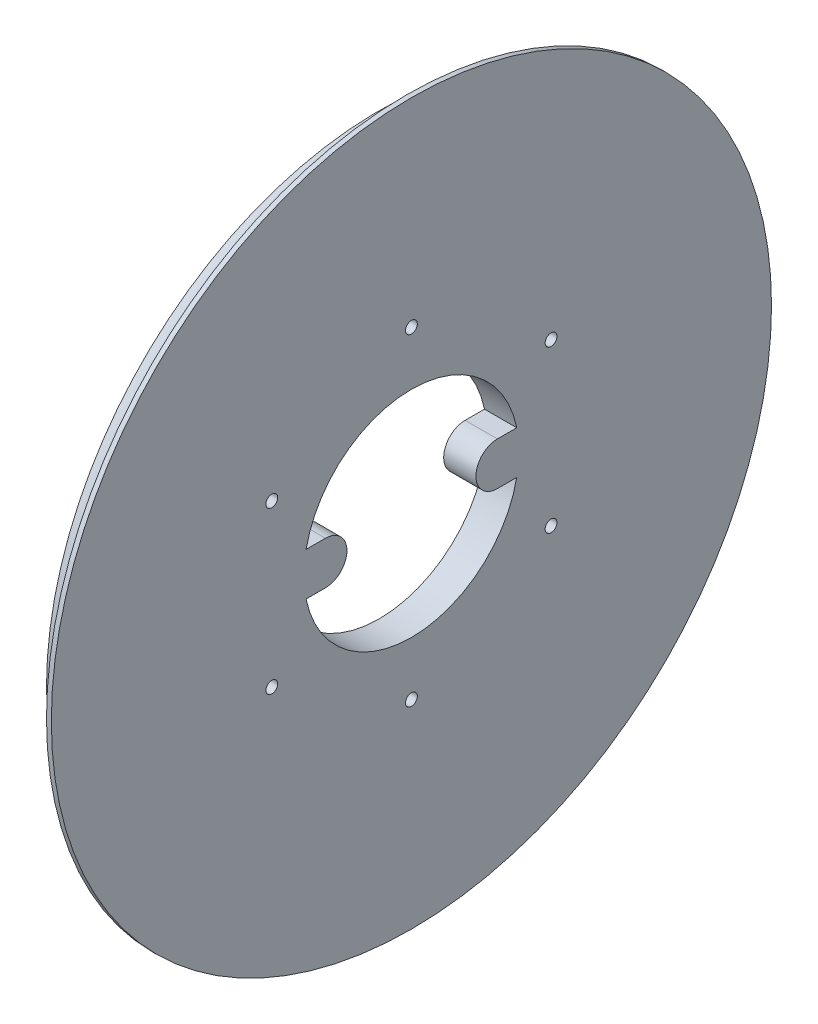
ISO-10303-21;
HEADER;
FILE_DESCRIPTION(('STEP AP214'),'2;1');
FILE_NAME('part.step','',(''),(''),'','','');
FILE_SCHEMA(('AUTOMOTIVE_DESIGN { 1 0 10303 214 1 1 1 1 }'));
ENDSEC;
DATA;
#1=APPLICATION_CONTEXT('core data for automotive mechanical design processes');
#2=APPLICATION_PROTOCOL_DEFINITION('international standard','automotive_design',2000,#1);
#3=PRODUCT_CONTEXT('',#1,'mechanical');
#4=PRODUCT('Part','Part','',(#3));
#5=PRODUCT_RELATED_PRODUCT_CATEGORY('part','',(#4));
#6=PRODUCT_DEFINITION_FORMATION('','',#4);
#7=PRODUCT_DEFINITION_CONTEXT('part definition',#1,'design');
#8=PRODUCT_DEFINITION('design','',#6,#7);
#9=PRODUCT_DEFINITION_SHAPE('','',#8);
#10=(LENGTH_UNIT() NAMED_UNIT(*) SI_UNIT(.MILLI.,.METRE.));
#11=(NAMED_UNIT(*) PLANE_ANGLE_UNIT() SI_UNIT($,.RADIAN.));
#12=(NAMED_UNIT(*) SI_UNIT($,.STERADIAN.) SOLID_ANGLE_UNIT());
#13=UNCERTAINTY_MEASURE_WITH_UNIT(LENGTH_MEASURE(1.E-05),#10,'distance_accuracy_value','');
#14=(GEOMETRIC_REPRESENTATION_CONTEXT(3) GLOBAL_UNCERTAINTY_ASSIGNED_CONTEXT((#13)) GLOBAL_UNIT_ASSIGNED_CONTEXT((#10,
#11,#12)) REPRESENTATION_CONTEXT('',''));
#15=CARTESIAN_POINT('',(0.,0.,0.));
#16=DIRECTION('',(0.,0.,1.));
#17=DIRECTION('',(1.,0.,0.));
#18=AXIS2_PLACEMENT_3D('',#15,#16,#17);
#19=CARTESIAN_POINT('',(11.9999999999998,66.9999999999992,0.));
#20=DIRECTION('',(1.,0.,0.));
#21=DIRECTION('',(0.,0.,-1.));
#22=AXIS2_PLACEMENT_3D('',#19,#20,#21);
#23=PLANE('',#22);
#24=CARTESIAN_POINT('',(11.9999999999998,15.0000000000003,-25.980762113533));
#25=DIRECTION('',(-1.,0.,0.));
#26=DIRECTION('',(0.,0.,1.));
#27=AXIS2_PLACEMENT_3D('',#24,#25,#26);
#28=CIRCLE('',#27,1.1);
#29=CARTESIAN_POINT('',(11.9999999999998,15.0000000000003,-24.880762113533));
#30=VERTEX_POINT('',#29);
#31=EDGE_CURVE('E249',#30,#30,#28,.T.);
#32=ORIENTED_EDGE('',*,*,#31,.T.);
#33=EDGE_LOOP('',(#32));
#34=FACE_BOUND('',#33,.T.);
#35=CARTESIAN_POINT('',(11.9999999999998,-15.0000000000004,-25.9807621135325));
#36=DIRECTION('',(-1.,0.,0.));
#37=DIRECTION('',(0.,0.,1.));
#38=AXIS2_PLACEMENT_3D('',#35,#36,#37);
#39=CIRCLE('',#38,1.100000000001);
#40=CARTESIAN_POINT('',(11.9999999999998,-15.0000000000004,-24.8807621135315));
#41=VERTEX_POINT('',#40);
#42=EDGE_CURVE('E257',#41,#41,#39,.T.);
#43=ORIENTED_EDGE('',*,*,#42,.T.);
#44=EDGE_LOOP('',(#43));
#45=FACE_BOUND('',#44,.T.);
#46=CARTESIAN_POINT('',(11.9999999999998,-30.,8.52170513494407E-13));
#47=DIRECTION('',(-1.,0.,0.));
#48=DIRECTION('',(0.,0.,1.));
#49=AXIS2_PLACEMENT_3D('',#46,#47,#48);
#50=CIRCLE('',#49,1.10000000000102);
#51=CARTESIAN_POINT('',(11.9999999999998,-30.,1.10000000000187));
#52=VERTEX_POINT('',#51);
#53=EDGE_CURVE('E263',#52,#52,#50,.T.);
#54=ORIENTED_EDGE('',*,*,#53,.T.);
#55=EDGE_LOOP('',(#54));
#56=FACE_BOUND('',#55,.T.);
#57=CARTESIAN_POINT('',(11.9999999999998,-14.9999999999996,25.9807621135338));
#58=DIRECTION('',(-1.,0.,0.));
#59=DIRECTION('',(0.,0.,1.));
#60=AXIS2_PLACEMENT_3D('',#57,#58,#59);
#61=CIRCLE('',#60,1.10000000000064);
#62=CARTESIAN_POINT('',(11.9999999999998,-14.9999999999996,27.0807621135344));
#63=VERTEX_POINT('',#62);
#64=EDGE_CURVE('E269',#63,#63,#61,.T.);
#65=ORIENTED_EDGE('',*,*,#64,.T.);
#66=EDGE_LOOP('',(#65));
#67=FACE_BOUND('',#66,.T.);
#68=CARTESIAN_POINT('',(11.9999999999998,14.9999999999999,25.9807621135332));
#69=DIRECTION('',(-1.,0.,0.));
#70=DIRECTION('',(0.,0.,1.));
#71=AXIS2_PLACEMENT_3D('',#68,#69,#70);
#72=CIRCLE('',#71,1.1);
#73=CARTESIAN_POINT('',(11.9999999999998,14.9999999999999,27.0807621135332));
#74=VERTEX_POINT('',#73);
#75=EDGE_CURVE('E275',#74,#74,#72,.T.);
#76=ORIENTED_EDGE('',*,*,#75,.T.);
#77=EDGE_LOOP('',(#76));
#78=FACE_BOUND('',#77,.T.);
#79=CARTESIAN_POINT('',(11.9999999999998,30.,0.));
#80=DIRECTION('',(-1.,0.,0.));
#81=DIRECTION('',(0.,0.,1.));
#82=AXIS2_PLACEMENT_3D('',#79,#80,#81);
#83=CIRCLE('',#82,1.1);
#84=CARTESIAN_POINT('',(11.9999999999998,30.,1.1));
#85=VERTEX_POINT('',#84);
#86=EDGE_CURVE('E143',#85,#85,#83,.T.);
#87=ORIENTED_EDGE('',*,*,#86,.T.);
#88=EDGE_LOOP('',(#87));
#89=FACE_BOUND('',#88,.T.);
#90=CARTESIAN_POINT('',(11.9999999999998,0.,-16.));
#91=DIRECTION('',(1.,0.,0.));
#92=DIRECTION('',(0.,0.,1.));
#93=AXIS2_PLACEMENT_3D('',#90,#91,#92);
#94=CIRCLE('',#93,4.);
#95=CARTESIAN_POINT('',(11.9999999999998,4.,-16.));
#96=VERTEX_POINT('',#95);
#97=CARTESIAN_POINT('',(11.9999999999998,-4.,-16.));
#98=VERTEX_POINT('',#97);
#99=EDGE_CURVE('E103',#96,#98,#94,.T.);
#100=ORIENTED_EDGE('',*,*,#99,.T.);
#101=DIRECTION('',(0.,0.,-1.));
#102=VECTOR('',#101,1.);
#103=CARTESIAN_POINT('',(11.9999999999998,-4.,-19.5959179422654));
#104=LINE('',#103,#102);
#105=CARTESIAN_POINT('',(11.9999999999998,-4.,-19.5959179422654));
#106=VERTEX_POINT('',#105);
#107=EDGE_CURVE('E112',#98,#106,#104,.T.);
#108=ORIENTED_EDGE('',*,*,#107,.T.);
#109=CARTESIAN_POINT('',(11.9999999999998,0.,0.));
#110=DIRECTION('',(-1.,0.,0.));
#111=DIRECTION('',(0.,0.,1.));
#112=AXIS2_PLACEMENT_3D('',#109,#110,#111);
#113=CIRCLE('',#112,20.);
#114=CARTESIAN_POINT('',(11.9999999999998,-4.,19.5959179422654));
#115=VERTEX_POINT('',#114);
#116=EDGE_CURVE('E51',#106,#115,#113,.T.);
#117=ORIENTED_EDGE('',*,*,#116,.T.);
#118=DIRECTION('',(0.,0.,-1.));
#119=VECTOR('',#118,1.);
#120=CARTESIAN_POINT('',(11.9999999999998,-4.,19.5959179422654));
#121=LINE('',#120,#119);
#122=CARTESIAN_POINT('',(11.9999999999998,-4.,16.));
#123=VERTEX_POINT('',#122);
#124=EDGE_CURVE('E129',#115,#123,#121,.T.);
#125=ORIENTED_EDGE('',*,*,#124,.T.);
#126=CARTESIAN_POINT('',(11.9999999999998,0.,16.));
#127=DIRECTION('',(1.,0.,0.));
#128=DIRECTION('',(0.,0.,-1.));
#129=AXIS2_PLACEMENT_3D('',#126,#127,#128);
#130=CIRCLE('',#129,4.);
#131=CARTESIAN_POINT('',(11.9999999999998,4.,16.));
#132=VERTEX_POINT('',#131);
#133=EDGE_CURVE('E132',#123,#132,#130,.T.);
#134=ORIENTED_EDGE('',*,*,#133,.T.);
#135=DIRECTION('',(0.,0.,1.));
#136=VECTOR('',#135,1.);
#137=CARTESIAN_POINT('',(11.9999999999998,4.,19.5959179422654));
#138=LINE('',#137,#136);
#139=CARTESIAN_POINT('',(11.9999999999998,4.,19.5959179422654));
#140=VERTEX_POINT('',#139);
#141=EDGE_CURVE('E135',#132,#140,#138,.T.);
#142=ORIENTED_EDGE('',*,*,#141,.T.);
#143=CARTESIAN_POINT('',(11.9999999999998,0.,0.));
#144=DIRECTION('',(-1.,0.,0.));
#145=DIRECTION('',(0.,0.,1.));
#146=AXIS2_PLACEMENT_3D('',#143,#144,#145);
#147=CIRCLE('',#146,20.);
#148=CARTESIAN_POINT('',(11.9999999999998,4.,-19.5959179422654));
#149=VERTEX_POINT('',#148);
#150=EDGE_CURVE('E138',#140,#149,#147,.T.);
#151=ORIENTED_EDGE('',*,*,#150,.T.);
#152=DIRECTION('',(0.,0.,1.));
#153=VECTOR('',#152,1.);
#154=CARTESIAN_POINT('',(11.9999999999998,4.,-19.5959179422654));
#155=LINE('',#154,#153);
#156=EDGE_CURVE('E109',#149,#96,#155,.T.);
#157=ORIENTED_EDGE('',*,*,#156,.T.);
#158=EDGE_LOOP('',(#100,#108,#117,#125,#134,#142,#151,#157));
#159=FACE_BOUND('',#158,.T.);
#160=CARTESIAN_POINT('',(11.9999999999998,-7.77547884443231E-13,0.));
#161=DIRECTION('',(-1.,0.,0.));
#162=DIRECTION('',(0.,0.,1.));
#163=AXIS2_PLACEMENT_3D('',#160,#161,#162);
#164=CIRCLE('',#163,67.);
#165=CARTESIAN_POINT('',(11.9999999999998,-7.77547884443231E-13,67.));
#166=VERTEX_POINT('',#165);
#167=EDGE_CURVE('E11',#166,#166,#164,.T.);
#168=ORIENTED_EDGE('',*,*,#167,.F.);
#169=EDGE_LOOP('',(#168));
#170=FACE_BOUND('',#169,.T.);
#171=ADVANCED_FACE('F37',(#34,#45,#56,#67,#78,#89,#159,#170),#23,.T.);
#172=CARTESIAN_POINT('',(-19.0782144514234,-7.77547884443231E-13,0.));
#173=DIRECTION('',(-1.,0.,0.));
#174=DIRECTION('',(0.,0.,1.));
#175=AXIS2_PLACEMENT_3D('',#172,#173,#174);
#176=CYLINDRICAL_SURFACE('',#175,67.);
#177=ORIENTED_EDGE('',*,*,#167,.T.);
#178=EDGE_LOOP('',(#177));
#179=FACE_BOUND('',#178,.T.);
#180=CARTESIAN_POINT('',(11.0999999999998,-7.77547884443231E-13,0.));
#181=DIRECTION('',(-1.,0.,0.));
#182=DIRECTION('',(0.,0.,1.));
#183=AXIS2_PLACEMENT_3D('',#180,#181,#182);
#184=CIRCLE('',#183,67.);
#185=CARTESIAN_POINT('',(11.0999999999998,-7.77547884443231E-13,67.));
#186=VERTEX_POINT('',#185);
#187=EDGE_CURVE('E44',#186,#186,#184,.T.);
#188=ORIENTED_EDGE('',*,*,#187,.F.);
#189=EDGE_LOOP('',(#188));
#190=FACE_BOUND('',#189,.T.);
#191=ADVANCED_FACE('F180',(#179,#190),#176,.T.);
#192=CARTESIAN_POINT('',(5.99999999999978,-7.7715611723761E-13,0.));
#193=DIRECTION('',(-1.,0.,0.));
#194=DIRECTION('',(0.,0.,1.));
#195=AXIS2_PLACEMENT_3D('',#192,#193,#194);
#196=TOROIDAL_SURFACE('',#195,67.,5.1);
#197=ORIENTED_EDGE('',*,*,#187,.T.);
#198=EDGE_LOOP('',(#197));
#199=FACE_BOUND('',#198,.T.);
#200=CARTESIAN_POINT('',(5.99999999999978,-7.77547884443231E-13,0.));
#201=DIRECTION('',(-1.,0.,0.));
#202=DIRECTION('',(0.,0.,1.));
#203=AXIS2_PLACEMENT_3D('',#200,#201,#202);
#204=CIRCLE('',#203,61.9);
#205=CARTESIAN_POINT('',(5.99999999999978,-7.77547884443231E-13,61.9));
#206=VERTEX_POINT('',#205);
#207=EDGE_CURVE('E161',#206,#206,#204,.T.);
#208=ORIENTED_EDGE('',*,*,#207,.F.);
#209=EDGE_LOOP('',(#208));
#210=FACE_BOUND('',#209,.T.);
#211=ADVANCED_FACE('F177',(#199,#210),#196,.F.);
#212=CARTESIAN_POINT('',(5.99999999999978,61.8999999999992,0.));
#213=DIRECTION('',(1.,0.,0.));
#214=DIRECTION('',(0.,0.,-1.));
#215=AXIS2_PLACEMENT_3D('',#212,#213,#214);
#216=PLANE('',#215);
#217=CARTESIAN_POINT('',(5.99999999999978,15.0000000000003,-25.980762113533));
#218=DIRECTION('',(-1.,0.,0.));
#219=DIRECTION('',(0.,0.,1.));
#220=AXIS2_PLACEMENT_3D('',#217,#218,#219);
#221=CIRCLE('',#220,1.1);
#222=CARTESIAN_POINT('',(5.99999999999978,15.0000000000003,-24.880762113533));
#223=VERTEX_POINT('',#222);
#224=EDGE_CURVE('E252',#223,#223,#221,.T.);
#225=ORIENTED_EDGE('',*,*,#224,.F.);
#226=EDGE_LOOP('',(#225));
#227=FACE_BOUND('',#226,.T.);
#228=CARTESIAN_POINT('',(5.99999999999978,-15.0000000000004,-25.9807621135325));
#229=DIRECTION('',(-1.,0.,0.));
#230=DIRECTION('',(0.,0.,1.));
#231=AXIS2_PLACEMENT_3D('',#228,#229,#230);
#232=CIRCLE('',#231,1.100000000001);
#233=CARTESIAN_POINT('',(5.99999999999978,-15.0000000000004,-24.8807621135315));
#234=VERTEX_POINT('',#233);
#235=EDGE_CURVE('E254',#234,#234,#232,.T.);
#236=ORIENTED_EDGE('',*,*,#235,.F.);
#237=EDGE_LOOP('',(#236));
#238=FACE_BOUND('',#237,.T.);
#239=CARTESIAN_POINT('',(5.99999999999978,-30.,8.52170513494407E-13));
#240=DIRECTION('',(-1.,0.,0.));
#241=DIRECTION('',(0.,0.,1.));
#242=AXIS2_PLACEMENT_3D('',#239,#240,#241);
#243=CIRCLE('',#242,1.10000000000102);
#244=CARTESIAN_POINT('',(5.99999999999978,-30.,1.10000000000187));
#245=VERTEX_POINT('',#244);
#246=EDGE_CURVE('E260',#245,#245,#243,.T.);
#247=ORIENTED_EDGE('',*,*,#246,.F.);
#248=EDGE_LOOP('',(#247));
#249=FACE_BOUND('',#248,.T.);
#250=CARTESIAN_POINT('',(5.99999999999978,-14.9999999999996,25.9807621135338));
#251=DIRECTION('',(-1.,0.,0.));
#252=DIRECTION('',(0.,0.,1.));
#253=AXIS2_PLACEMENT_3D('',#250,#251,#252);
#254=CIRCLE('',#253,1.10000000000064);
#255=CARTESIAN_POINT('',(5.99999999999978,-14.9999999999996,27.0807621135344));
#256=VERTEX_POINT('',#255);
#257=EDGE_CURVE('E266',#256,#256,#254,.T.);
#258=ORIENTED_EDGE('',*,*,#257,.F.);
#259=EDGE_LOOP('',(#258));
#260=FACE_BOUND('',#259,.T.);
#261=CARTESIAN_POINT('',(5.99999999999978,14.9999999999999,25.9807621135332));
#262=DIRECTION('',(-1.,0.,0.));
#263=DIRECTION('',(0.,0.,1.));
#264=AXIS2_PLACEMENT_3D('',#261,#262,#263);
#265=CIRCLE('',#264,1.1);
#266=CARTESIAN_POINT('',(5.99999999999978,14.9999999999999,27.0807621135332));
#267=VERTEX_POINT('',#266);
#268=EDGE_CURVE('E272',#267,#267,#265,.T.);
#269=ORIENTED_EDGE('',*,*,#268,.F.);
#270=EDGE_LOOP('',(#269));
#271=FACE_BOUND('',#270,.T.);
#272=CARTESIAN_POINT('',(5.99999999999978,30.,0.));
#273=DIRECTION('',(-1.,0.,0.));
#274=DIRECTION('',(0.,0.,1.));
#275=AXIS2_PLACEMENT_3D('',#272,#273,#274);
#276=CIRCLE('',#275,1.1);
#277=CARTESIAN_POINT('',(5.99999999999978,30.,1.1));
#278=VERTEX_POINT('',#277);
#279=EDGE_CURVE('E125',#278,#278,#276,.T.);
#280=ORIENTED_EDGE('',*,*,#279,.F.);
#281=EDGE_LOOP('',(#280));
#282=FACE_BOUND('',#281,.T.);
#283=DIRECTION('',(0.,0.,-1.));
#284=VECTOR('',#283,1.);
#285=CARTESIAN_POINT('',(5.99999999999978,-4.,-19.5959179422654));
#286=LINE('',#285,#284);
#287=CARTESIAN_POINT('',(5.99999999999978,-4.,-16.));
#288=VERTEX_POINT('',#287);
#289=CARTESIAN_POINT('',(5.99999999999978,-4.,-19.5959179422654));
#290=VERTEX_POINT('',#289);
#291=EDGE_CURVE('E142',#288,#290,#286,.T.);
#292=ORIENTED_EDGE('',*,*,#291,.F.);
#293=CARTESIAN_POINT('',(5.99999999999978,0.,-16.));
#294=DIRECTION('',(1.,0.,0.));
#295=DIRECTION('',(0.,0.,1.));
#296=AXIS2_PLACEMENT_3D('',#293,#294,#295);
#297=CIRCLE('',#296,4.);
#298=CARTESIAN_POINT('',(5.99999999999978,4.,-16.));
#299=VERTEX_POINT('',#298);
#300=EDGE_CURVE('E59',#299,#288,#297,.T.);
#301=ORIENTED_EDGE('',*,*,#300,.F.);
#302=DIRECTION('',(0.,0.,1.));
#303=VECTOR('',#302,1.);
#304=CARTESIAN_POINT('',(5.99999999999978,4.,-19.5959179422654));
#305=LINE('',#304,#303);
#306=CARTESIAN_POINT('',(5.99999999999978,4.,-19.5959179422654));
#307=VERTEX_POINT('',#306);
#308=EDGE_CURVE('E119',#307,#299,#305,.T.);
#309=ORIENTED_EDGE('',*,*,#308,.F.);
#310=CARTESIAN_POINT('',(5.99999999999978,0.,0.));
#311=DIRECTION('',(-1.,0.,0.));
#312=DIRECTION('',(0.,0.,1.));
#313=AXIS2_PLACEMENT_3D('',#310,#311,#312);
#314=CIRCLE('',#313,20.);
#315=CARTESIAN_POINT('',(5.99999999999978,4.,19.5959179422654));
#316=VERTEX_POINT('',#315);
#317=EDGE_CURVE('E122',#316,#307,#314,.T.);
#318=ORIENTED_EDGE('',*,*,#317,.F.);
#319=DIRECTION('',(0.,0.,1.));
#320=VECTOR('',#319,1.);
#321=CARTESIAN_POINT('',(5.99999999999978,4.,19.5959179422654));
#322=LINE('',#321,#320);
#323=CARTESIAN_POINT('',(5.99999999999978,4.,16.));
#324=VERTEX_POINT('',#323);
#325=EDGE_CURVE('E154',#324,#316,#322,.T.);
#326=ORIENTED_EDGE('',*,*,#325,.F.);
#327=CARTESIAN_POINT('',(5.99999999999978,0.,16.));
#328=DIRECTION('',(1.,0.,0.));
#329=DIRECTION('',(0.,0.,-1.));
#330=AXIS2_PLACEMENT_3D('',#327,#328,#329);
#331=CIRCLE('',#330,4.);
#332=CARTESIAN_POINT('',(5.99999999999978,-4.,16.));
#333=VERTEX_POINT('',#332);
#334=EDGE_CURVE('E151',#333,#324,#331,.T.);
#335=ORIENTED_EDGE('',*,*,#334,.F.);
#336=DIRECTION('',(0.,0.,-1.));
#337=VECTOR('',#336,1.);
#338=CARTESIAN_POINT('',(5.99999999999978,-4.,19.5959179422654));
#339=LINE('',#338,#337);
#340=CARTESIAN_POINT('',(5.99999999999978,-4.,19.5959179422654));
#341=VERTEX_POINT('',#340);
#342=EDGE_CURVE('E148',#341,#333,#339,.T.);
#343=ORIENTED_EDGE('',*,*,#342,.F.);
#344=CARTESIAN_POINT('',(5.99999999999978,0.,0.));
#345=DIRECTION('',(-1.,0.,0.));
#346=DIRECTION('',(0.,0.,1.));
#347=AXIS2_PLACEMENT_3D('',#344,#345,#346);
#348=CIRCLE('',#347,20.);
#349=EDGE_CURVE('E145',#290,#341,#348,.T.);
#350=ORIENTED_EDGE('',*,*,#349,.F.);
#351=EDGE_LOOP('',(#292,#301,#309,#318,#326,#335,#343,#350));
#352=FACE_BOUND('',#351,.T.);
#353=ORIENTED_EDGE('',*,*,#207,.T.);
#354=EDGE_LOOP('',(#353));
#355=FACE_BOUND('',#354,.T.);
#356=ADVANCED_FACE('F187',(#227,#238,#249,#260,#271,#282,#352,#355),#216,.F.);
#357=CARTESIAN_POINT('',(11.9999999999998,0.,-16.));
#358=DIRECTION('',(-1.,0.,0.));
#359=DIRECTION('',(0.,0.,1.));
#360=AXIS2_PLACEMENT_3D('',#357,#358,#359);
#361=CYLINDRICAL_SURFACE('',#360,4.);
#362=ORIENTED_EDGE('',*,*,#300,.T.);
#363=DIRECTION('',(-1.,0.,0.));
#364=VECTOR('',#363,1.);
#365=CARTESIAN_POINT('',(11.9999999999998,-4.,-16.));
#366=LINE('',#365,#364);
#367=EDGE_CURVE('E99',#98,#288,#366,.T.);
#368=ORIENTED_EDGE('',*,*,#367,.F.);
#369=ORIENTED_EDGE('',*,*,#99,.F.);
#370=DIRECTION('',(-1.,0.,0.));
#371=VECTOR('',#370,1.);
#372=CARTESIAN_POINT('',(11.9999999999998,4.,-16.));
#373=LINE('',#372,#371);
#374=EDGE_CURVE('E159',#96,#299,#373,.T.);
#375=ORIENTED_EDGE('',*,*,#374,.T.);
#376=EDGE_LOOP('',(#362,#368,#369,#375));
#377=FACE_BOUND('',#376,.T.);
#378=ADVANCED_FACE('F101',(#377),#361,.T.);
#379=CARTESIAN_POINT('',(11.9999999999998,4.,-19.5959179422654));
#380=DIRECTION('',(0.,-1.,0.));
#381=DIRECTION('',(0.,0.,-1.));
#382=AXIS2_PLACEMENT_3D('',#379,#380,#381);
#383=PLANE('',#382);
#384=ORIENTED_EDGE('',*,*,#308,.T.);
#385=ORIENTED_EDGE('',*,*,#374,.F.);
#386=ORIENTED_EDGE('',*,*,#156,.F.);
#387=DIRECTION('',(-1.,0.,0.));
#388=VECTOR('',#387,1.);
#389=CARTESIAN_POINT('',(11.9999999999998,4.,-19.5959179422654));
#390=LINE('',#389,#388);
#391=EDGE_CURVE('E162',#149,#307,#390,.T.);
#392=ORIENTED_EDGE('',*,*,#391,.T.);
#393=EDGE_LOOP('',(#384,#385,#386,#392));
#394=FACE_BOUND('',#393,.T.);
#395=ADVANCED_FACE('F196',(#394),#383,.F.);
#396=CARTESIAN_POINT('',(11.9999999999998,0.,0.));
#397=DIRECTION('',(-1.,0.,0.));
#398=DIRECTION('',(0.,0.,1.));
#399=AXIS2_PLACEMENT_3D('',#396,#397,#398);
#400=CYLINDRICAL_SURFACE('',#399,20.);
#401=ORIENTED_EDGE('',*,*,#317,.T.);
#402=ORIENTED_EDGE('',*,*,#391,.F.);
#403=ORIENTED_EDGE('',*,*,#150,.F.);
#404=DIRECTION('',(-1.,0.,0.));
#405=VECTOR('',#404,1.);
#406=CARTESIAN_POINT('',(11.9999999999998,4.,19.5959179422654));
#407=LINE('',#406,#405);
#408=EDGE_CURVE('E164',#140,#316,#407,.T.);
#409=ORIENTED_EDGE('',*,*,#408,.T.);
#410=EDGE_LOOP('',(#401,#402,#403,#409));
#411=FACE_BOUND('',#410,.T.);
#412=ADVANCED_FACE('F214',(#411),#400,.F.);
#413=CARTESIAN_POINT('',(11.9999999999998,4.,19.5959179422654));
#414=DIRECTION('',(0.,-1.,0.));
#415=DIRECTION('',(0.,0.,-1.));
#416=AXIS2_PLACEMENT_3D('',#413,#414,#415);
#417=PLANE('',#416);
#418=ORIENTED_EDGE('',*,*,#325,.T.);
#419=ORIENTED_EDGE('',*,*,#408,.F.);
#420=ORIENTED_EDGE('',*,*,#141,.F.);
#421=DIRECTION('',(-1.,0.,0.));
#422=VECTOR('',#421,1.);
#423=CARTESIAN_POINT('',(11.9999999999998,4.,16.));
#424=LINE('',#423,#422);
#425=EDGE_CURVE('E166',#132,#324,#424,.T.);
#426=ORIENTED_EDGE('',*,*,#425,.T.);
#427=EDGE_LOOP('',(#418,#419,#420,#426));
#428=FACE_BOUND('',#427,.T.);
#429=ADVANCED_FACE('F210',(#428),#417,.F.);
#430=CARTESIAN_POINT('',(11.9999999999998,0.,16.));
#431=DIRECTION('',(-1.,0.,0.));
#432=DIRECTION('',(0.,0.,1.));
#433=AXIS2_PLACEMENT_3D('',#430,#431,#432);
#434=CYLINDRICAL_SURFACE('',#433,4.);
#435=ORIENTED_EDGE('',*,*,#334,.T.);
#436=ORIENTED_EDGE('',*,*,#425,.F.);
#437=ORIENTED_EDGE('',*,*,#133,.F.);
#438=DIRECTION('',(-1.,0.,0.));
#439=VECTOR('',#438,1.);
#440=CARTESIAN_POINT('',(11.9999999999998,-4.,16.));
#441=LINE('',#440,#439);
#442=EDGE_CURVE('E168',#123,#333,#441,.T.);
#443=ORIENTED_EDGE('',*,*,#442,.T.);
#444=EDGE_LOOP('',(#435,#436,#437,#443));
#445=FACE_BOUND('',#444,.T.);
#446=ADVANCED_FACE('F206',(#445),#434,.T.);
#447=CARTESIAN_POINT('',(11.9999999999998,-4.,19.5959179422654));
#448=DIRECTION('',(0.,1.,0.));
#449=DIRECTION('',(0.,0.,1.));
#450=AXIS2_PLACEMENT_3D('',#447,#448,#449);
#451=PLANE('',#450);
#452=ORIENTED_EDGE('',*,*,#342,.T.);
#453=ORIENTED_EDGE('',*,*,#442,.F.);
#454=ORIENTED_EDGE('',*,*,#124,.F.);
#455=DIRECTION('',(-1.,0.,0.));
#456=VECTOR('',#455,1.);
#457=CARTESIAN_POINT('',(11.9999999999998,-4.,19.5959179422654));
#458=LINE('',#457,#456);
#459=EDGE_CURVE('E170',#115,#341,#458,.T.);
#460=ORIENTED_EDGE('',*,*,#459,.T.);
#461=EDGE_LOOP('',(#452,#453,#454,#460));
#462=FACE_BOUND('',#461,.T.);
#463=ADVANCED_FACE('F203',(#462),#451,.F.);
#464=CARTESIAN_POINT('',(11.9999999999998,0.,0.));
#465=DIRECTION('',(-1.,0.,0.));
#466=DIRECTION('',(0.,0.,1.));
#467=AXIS2_PLACEMENT_3D('',#464,#465,#466);
#468=CYLINDRICAL_SURFACE('',#467,20.);
#469=ORIENTED_EDGE('',*,*,#349,.T.);
#470=ORIENTED_EDGE('',*,*,#459,.F.);
#471=ORIENTED_EDGE('',*,*,#116,.F.);
#472=DIRECTION('',(-1.,0.,0.));
#473=VECTOR('',#472,1.);
#474=CARTESIAN_POINT('',(11.9999999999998,-4.,-19.5959179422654));
#475=LINE('',#474,#473);
#476=EDGE_CURVE('E108',#106,#290,#475,.T.);
#477=ORIENTED_EDGE('',*,*,#476,.T.);
#478=EDGE_LOOP('',(#469,#470,#471,#477));
#479=FACE_BOUND('',#478,.T.);
#480=ADVANCED_FACE('F200',(#479),#468,.F.);
#481=CARTESIAN_POINT('',(11.9999999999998,-4.,-19.5959179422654));
#482=DIRECTION('',(0.,1.,0.));
#483=DIRECTION('',(0.,0.,1.));
#484=AXIS2_PLACEMENT_3D('',#481,#482,#483);
#485=PLANE('',#484);
#486=ORIENTED_EDGE('',*,*,#291,.T.);
#487=ORIENTED_EDGE('',*,*,#476,.F.);
#488=ORIENTED_EDGE('',*,*,#107,.F.);
#489=ORIENTED_EDGE('',*,*,#367,.T.);
#490=EDGE_LOOP('',(#486,#487,#488,#489));
#491=FACE_BOUND('',#490,.T.);
#492=ADVANCED_FACE('F113',(#491),#485,.F.);
#493=CARTESIAN_POINT('',(11.9999999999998,30.,0.));
#494=DIRECTION('',(-1.,0.,0.));
#495=DIRECTION('',(0.,0.,1.));
#496=AXIS2_PLACEMENT_3D('',#493,#494,#495);
#497=CYLINDRICAL_SURFACE('',#496,1.1);
#498=ORIENTED_EDGE('',*,*,#86,.F.);
#499=EDGE_LOOP('',(#498));
#500=FACE_BOUND('',#499,.T.);
#501=ORIENTED_EDGE('',*,*,#279,.T.);
#502=EDGE_LOOP('',(#501));
#503=FACE_BOUND('',#502,.T.);
#504=ADVANCED_FACE('F199',(#500,#503),#497,.F.);
#505=CARTESIAN_POINT('',(11.9999999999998,14.9999999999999,25.9807621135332));
#506=DIRECTION('',(-1.,0.,0.));
#507=DIRECTION('',(0.,0.,1.));
#508=AXIS2_PLACEMENT_3D('',#505,#506,#507);
#509=CYLINDRICAL_SURFACE('',#508,1.1);
#510=ORIENTED_EDGE('',*,*,#75,.F.);
#511=EDGE_LOOP('',(#510));
#512=FACE_BOUND('',#511,.T.);
#513=ORIENTED_EDGE('',*,*,#268,.T.);
#514=EDGE_LOOP('',(#513));
#515=FACE_BOUND('',#514,.T.);
#516=ADVANCED_FACE('F224',(#512,#515),#509,.F.);
#517=CARTESIAN_POINT('',(11.9999999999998,-14.9999999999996,25.9807621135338));
#518=DIRECTION('',(-1.,0.,0.));
#519=DIRECTION('',(0.,0.,1.));
#520=AXIS2_PLACEMENT_3D('',#517,#518,#519);
#521=CYLINDRICAL_SURFACE('',#520,1.10000000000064);
#522=ORIENTED_EDGE('',*,*,#64,.F.);
#523=EDGE_LOOP('',(#522));
#524=FACE_BOUND('',#523,.T.);
#525=ORIENTED_EDGE('',*,*,#257,.T.);
#526=EDGE_LOOP('',(#525));
#527=FACE_BOUND('',#526,.T.);
#528=ADVANCED_FACE('F228',(#524,#527),#521,.F.);
#529=CARTESIAN_POINT('',(11.9999999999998,-30.,8.52170513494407E-13));
#530=DIRECTION('',(-1.,0.,0.));
#531=DIRECTION('',(0.,0.,1.));
#532=AXIS2_PLACEMENT_3D('',#529,#530,#531);
#533=CYLINDRICAL_SURFACE('',#532,1.10000000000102);
#534=ORIENTED_EDGE('',*,*,#53,.F.);
#535=EDGE_LOOP('',(#534));
#536=FACE_BOUND('',#535,.T.);
#537=ORIENTED_EDGE('',*,*,#246,.T.);
#538=EDGE_LOOP('',(#537));
#539=FACE_BOUND('',#538,.T.);
#540=ADVANCED_FACE('F232',(#536,#539),#533,.F.);
#541=CARTESIAN_POINT('',(11.9999999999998,-15.0000000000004,-25.9807621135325));
#542=DIRECTION('',(-1.,0.,0.));
#543=DIRECTION('',(0.,0.,1.));
#544=AXIS2_PLACEMENT_3D('',#541,#542,#543);
#545=CYLINDRICAL_SURFACE('',#544,1.100000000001);
#546=ORIENTED_EDGE('',*,*,#42,.F.);
#547=EDGE_LOOP('',(#546));
#548=FACE_BOUND('',#547,.T.);
#549=ORIENTED_EDGE('',*,*,#235,.T.);
#550=EDGE_LOOP('',(#549));
#551=FACE_BOUND('',#550,.T.);
#552=ADVANCED_FACE('F236',(#548,#551),#545,.F.);
#553=CARTESIAN_POINT('',(11.9999999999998,15.0000000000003,-25.980762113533));
#554=DIRECTION('',(-1.,0.,0.));
#555=DIRECTION('',(0.,0.,1.));
#556=AXIS2_PLACEMENT_3D('',#553,#554,#555);
#557=CYLINDRICAL_SURFACE('',#556,1.1);
#558=ORIENTED_EDGE('',*,*,#31,.F.);
#559=EDGE_LOOP('',(#558));
#560=FACE_BOUND('',#559,.T.);
#561=ORIENTED_EDGE('',*,*,#224,.T.);
#562=EDGE_LOOP('',(#561));
#563=FACE_BOUND('',#562,.T.);
#564=ADVANCED_FACE('F240',(#560,#563),#557,.F.);
#565=CLOSED_SHELL('',(#171,#191,#211,#356,#378,#395,#412,#429,#446,#463,#480,#492,#504,#516,
#528,#540,#552,#564));
#566=MANIFOLD_SOLID_BREP('B2',#565);
#567=ADVANCED_BREP_SHAPE_REPRESENTATION('',(#18,#566),#14);
#568=SHAPE_DEFINITION_REPRESENTATION(#9,#567);
ENDSEC;
END-ISO-10303-21;
